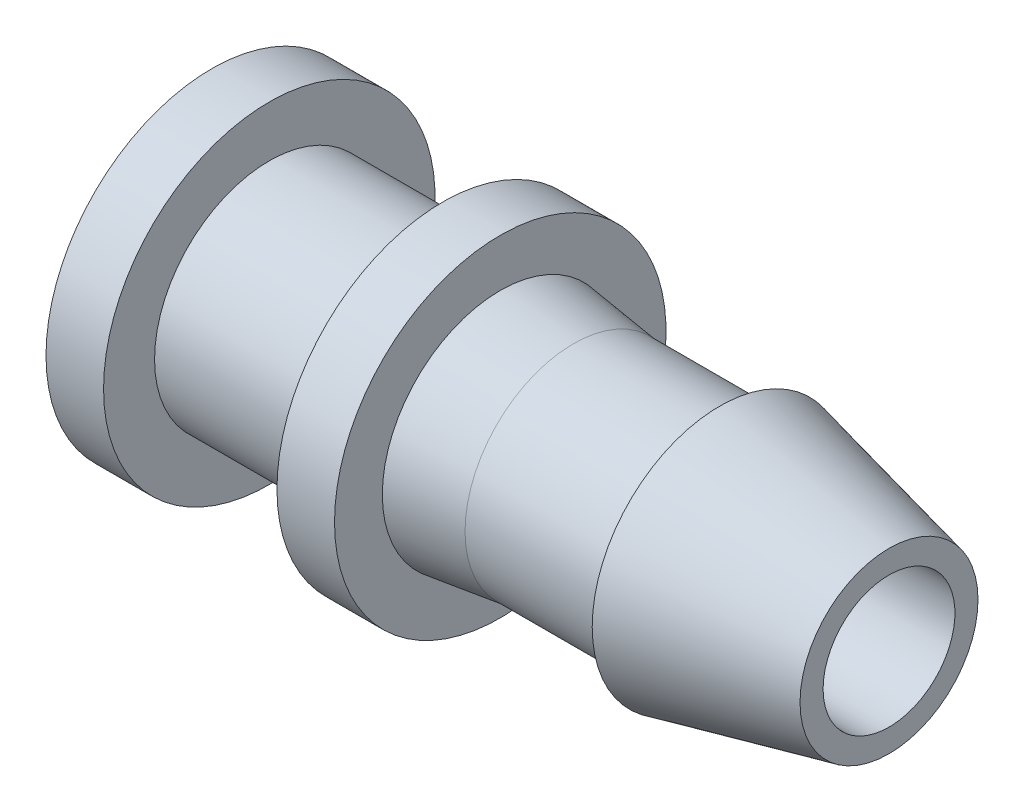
ISO-10303-21;
HEADER;
FILE_DESCRIPTION(('STEP AP214'),'2;1');
FILE_NAME('part.step','',(''),(''),'','','');
FILE_SCHEMA(('AUTOMOTIVE_DESIGN { 1 0 10303 214 1 1 1 1 }'));
ENDSEC;
DATA;
#1=APPLICATION_CONTEXT('core data for automotive mechanical design processes');
#2=APPLICATION_PROTOCOL_DEFINITION('international standard','automotive_design',2000,#1);
#3=PRODUCT_CONTEXT('',#1,'mechanical');
#4=PRODUCT('Part','Part','',(#3));
#5=PRODUCT_RELATED_PRODUCT_CATEGORY('part','',(#4));
#6=PRODUCT_DEFINITION_FORMATION('','',#4);
#7=PRODUCT_DEFINITION_CONTEXT('part definition',#1,'design');
#8=PRODUCT_DEFINITION('design','',#6,#7);
#9=PRODUCT_DEFINITION_SHAPE('','',#8);
#10=(LENGTH_UNIT() NAMED_UNIT(*) SI_UNIT(.MILLI.,.METRE.));
#11=(NAMED_UNIT(*) PLANE_ANGLE_UNIT() SI_UNIT($,.RADIAN.));
#12=(NAMED_UNIT(*) SI_UNIT($,.STERADIAN.) SOLID_ANGLE_UNIT());
#13=UNCERTAINTY_MEASURE_WITH_UNIT(LENGTH_MEASURE(1.E-05),#10,'distance_accuracy_value','');
#14=(GEOMETRIC_REPRESENTATION_CONTEXT(3) GLOBAL_UNCERTAINTY_ASSIGNED_CONTEXT((#13)) GLOBAL_UNIT_ASSIGNED_CONTEXT((#10,
#11,#12)) REPRESENTATION_CONTEXT('',''));
#15=CARTESIAN_POINT('',(0.,0.,0.));
#16=DIRECTION('',(0.,0.,1.));
#17=DIRECTION('',(1.,0.,0.));
#18=AXIS2_PLACEMENT_3D('',#15,#16,#17);
#19=CARTESIAN_POINT('',(0.,0.,0.));
#20=DIRECTION('',(-1.,0.,0.));
#21=DIRECTION('',(0.,0.,1.));
#22=AXIS2_PLACEMENT_3D('',#19,#20,#21);
#23=CYLINDRICAL_SURFACE('',#22,2.3114);
#24=CARTESIAN_POINT('',(18.690463,0.,0.));
#25=DIRECTION('',(-1.,0.,0.));
#26=DIRECTION('',(0.,0.,1.));
#27=AXIS2_PLACEMENT_3D('',#24,#25,#26);
#28=CIRCLE('',#27,2.3114);
#29=CARTESIAN_POINT('',(18.690463,0.,2.3114));
#30=VERTEX_POINT('',#29);
#31=EDGE_CURVE('E76',#30,#30,#28,.T.);
#32=ORIENTED_EDGE('',*,*,#31,.F.);
#33=EDGE_LOOP('',(#32));
#34=FACE_BOUND('',#33,.T.);
#35=CARTESIAN_POINT('',(-3.039872,0.,0.));
#36=DIRECTION('',(-1.,0.,0.));
#37=DIRECTION('',(0.,0.,1.));
#38=AXIS2_PLACEMENT_3D('',#35,#36,#37);
#39=CIRCLE('',#38,2.3114);
#40=CARTESIAN_POINT('',(-3.039872,0.,2.3114));
#41=VERTEX_POINT('',#40);
#42=EDGE_CURVE('E10',#41,#41,#39,.T.);
#43=ORIENTED_EDGE('',*,*,#42,.T.);
#44=EDGE_LOOP('',(#43));
#45=FACE_BOUND('',#44,.T.);
#46=ADVANCED_FACE('F33',(#34,#45),#23,.F.);
#47=CARTESIAN_POINT('',(-3.039872,0.,0.));
#48=DIRECTION('',(-1.,0.,0.));
#49=DIRECTION('',(0.,0.,1.));
#50=AXIS2_PLACEMENT_3D('',#47,#48,#49);
#51=PLANE('',#50);
#52=ORIENTED_EDGE('',*,*,#42,.F.);
#53=EDGE_LOOP('',(#52));
#54=FACE_BOUND('',#53,.T.);
#55=ADVANCED_FACE('F83',(#54),#51,.F.);
#56=CARTESIAN_POINT('',(-5.058537,0.,0.));
#57=DIRECTION('',(1.,0.,0.));
#58=DIRECTION('',(0.,0.,-1.));
#59=AXIS2_PLACEMENT_3D('',#56,#57,#58);
#60=PLANE('',#59);
#61=CARTESIAN_POINT('',(-5.058537,0.,0.));
#62=DIRECTION('',(-1.,0.,0.));
#63=DIRECTION('',(0.,0.,1.));
#64=AXIS2_PLACEMENT_3D('',#61,#62,#63);
#65=CIRCLE('',#64,5.81152);
#66=CARTESIAN_POINT('',(-5.058537,0.,5.81152));
#67=VERTEX_POINT('',#66);
#68=EDGE_CURVE('E39',#67,#67,#65,.T.);
#69=ORIENTED_EDGE('',*,*,#68,.T.);
#70=EDGE_LOOP('',(#69));
#71=FACE_BOUND('',#70,.T.);
#72=ADVANCED_FACE('F87',(#71),#60,.F.);
#73=CARTESIAN_POINT('',(0.,0.,0.));
#74=DIRECTION('',(-1.,0.,0.));
#75=DIRECTION('',(0.,0.,1.));
#76=AXIS2_PLACEMENT_3D('',#73,#74,#75);
#77=CYLINDRICAL_SURFACE('',#76,5.81152);
#78=ORIENTED_EDGE('',*,*,#68,.F.);
#79=EDGE_LOOP('',(#78));
#80=FACE_BOUND('',#79,.T.);
#81=CARTESIAN_POINT('',(-3.039872,0.,0.));
#82=DIRECTION('',(-1.,0.,0.));
#83=DIRECTION('',(0.,0.,1.));
#84=AXIS2_PLACEMENT_3D('',#81,#82,#83);
#85=CIRCLE('',#84,5.81152);
#86=CARTESIAN_POINT('',(-3.039872,0.,5.81152));
#87=VERTEX_POINT('',#86);
#88=EDGE_CURVE('E43',#87,#87,#85,.T.);
#89=ORIENTED_EDGE('',*,*,#88,.T.);
#90=EDGE_LOOP('',(#89));
#91=FACE_BOUND('',#90,.T.);
#92=ADVANCED_FACE('F92',(#80,#91),#77,.T.);
#93=CARTESIAN_POINT('',(-3.039872,5.81152,0.));
#94=DIRECTION('',(-1.,0.,0.));
#95=DIRECTION('',(0.,0.,1.));
#96=AXIS2_PLACEMENT_3D('',#93,#94,#95);
#97=PLANE('',#96);
#98=ORIENTED_EDGE('',*,*,#88,.F.);
#99=EDGE_LOOP('',(#98));
#100=FACE_BOUND('',#99,.T.);
#101=CARTESIAN_POINT('',(-3.039872,0.,0.));
#102=DIRECTION('',(-1.,0.,0.));
#103=DIRECTION('',(0.,0.,1.));
#104=AXIS2_PLACEMENT_3D('',#101,#102,#103);
#105=CIRCLE('',#104,4.02336);
#106=CARTESIAN_POINT('',(-3.039872,0.,4.02336));
#107=VERTEX_POINT('',#106);
#108=EDGE_CURVE('E47',#107,#107,#105,.T.);
#109=ORIENTED_EDGE('',*,*,#108,.T.);
#110=EDGE_LOOP('',(#109));
#111=FACE_BOUND('',#110,.T.);
#112=ADVANCED_FACE('F97',(#100,#111),#97,.F.);
#113=CARTESIAN_POINT('',(0.,0.,0.));
#114=DIRECTION('',(-1.,0.,0.));
#115=DIRECTION('',(0.,0.,1.));
#116=AXIS2_PLACEMENT_3D('',#113,#114,#115);
#117=CYLINDRICAL_SURFACE('',#116,4.02336);
#118=ORIENTED_EDGE('',*,*,#108,.F.);
#119=EDGE_LOOP('',(#118));
#120=FACE_BOUND('',#119,.T.);
#121=CARTESIAN_POINT('',(3.039872,0.,0.));
#122=DIRECTION('',(-1.,0.,0.));
#123=DIRECTION('',(0.,0.,1.));
#124=AXIS2_PLACEMENT_3D('',#121,#122,#123);
#125=CIRCLE('',#124,4.02336);
#126=CARTESIAN_POINT('',(3.039872,0.,4.02336));
#127=VERTEX_POINT('',#126);
#128=EDGE_CURVE('E52',#127,#127,#125,.T.);
#129=ORIENTED_EDGE('',*,*,#128,.T.);
#130=EDGE_LOOP('',(#129));
#131=FACE_BOUND('',#130,.T.);
#132=ADVANCED_FACE('F101',(#120,#131),#117,.T.);
#133=CARTESIAN_POINT('',(3.039872,5.81152,0.));
#134=DIRECTION('',(1.,0.,0.));
#135=DIRECTION('',(0.,0.,-1.));
#136=AXIS2_PLACEMENT_3D('',#133,#134,#135);
#137=PLANE('',#136);
#138=ORIENTED_EDGE('',*,*,#128,.F.);
#139=EDGE_LOOP('',(#138));
#140=FACE_BOUND('',#139,.T.);
#141=CARTESIAN_POINT('',(3.039872,0.,0.));
#142=DIRECTION('',(-1.,0.,0.));
#143=DIRECTION('',(0.,0.,1.));
#144=AXIS2_PLACEMENT_3D('',#141,#142,#143);
#145=CIRCLE('',#144,5.81152);
#146=CARTESIAN_POINT('',(3.039872,0.,5.81152));
#147=VERTEX_POINT('',#146);
#148=EDGE_CURVE('E55',#147,#147,#145,.T.);
#149=ORIENTED_EDGE('',*,*,#148,.T.);
#150=EDGE_LOOP('',(#149));
#151=FACE_BOUND('',#150,.T.);
#152=ADVANCED_FACE('F105',(#140,#151),#137,.F.);
#153=CARTESIAN_POINT('',(0.,0.,0.));
#154=DIRECTION('',(-1.,0.,0.));
#155=DIRECTION('',(0.,0.,1.));
#156=AXIS2_PLACEMENT_3D('',#153,#154,#155);
#157=CYLINDRICAL_SURFACE('',#156,5.81152);
#158=ORIENTED_EDGE('',*,*,#148,.F.);
#159=EDGE_LOOP('',(#158));
#160=FACE_BOUND('',#159,.T.);
#161=CARTESIAN_POINT('',(5.058537,0.,0.));
#162=DIRECTION('',(-1.,0.,0.));
#163=DIRECTION('',(0.,0.,1.));
#164=AXIS2_PLACEMENT_3D('',#161,#162,#163);
#165=CIRCLE('',#164,5.81152);
#166=CARTESIAN_POINT('',(5.058537,0.,5.81152));
#167=VERTEX_POINT('',#166);
#168=EDGE_CURVE('E58',#167,#167,#165,.T.);
#169=ORIENTED_EDGE('',*,*,#168,.T.);
#170=EDGE_LOOP('',(#169));
#171=FACE_BOUND('',#170,.T.);
#172=ADVANCED_FACE('F109',(#160,#171),#157,.T.);
#173=CARTESIAN_POINT('',(5.058537,4.13512,0.));
#174=DIRECTION('',(-1.,0.,0.));
#175=DIRECTION('',(0.,0.,1.));
#176=AXIS2_PLACEMENT_3D('',#173,#174,#175);
#177=PLANE('',#176);
#178=ORIENTED_EDGE('',*,*,#168,.F.);
#179=EDGE_LOOP('',(#178));
#180=FACE_BOUND('',#179,.T.);
#181=CARTESIAN_POINT('',(5.058537,0.,0.));
#182=DIRECTION('',(-1.,0.,0.));
#183=DIRECTION('',(0.,0.,1.));
#184=AXIS2_PLACEMENT_3D('',#181,#182,#183);
#185=CIRCLE('',#184,4.13512);
#186=CARTESIAN_POINT('',(5.058537,0.,4.13512));
#187=VERTEX_POINT('',#186);
#188=EDGE_CURVE('E61',#187,#187,#185,.T.);
#189=ORIENTED_EDGE('',*,*,#188,.T.);
#190=EDGE_LOOP('',(#189));
#191=FACE_BOUND('',#190,.T.);
#192=ADVANCED_FACE('F113',(#180,#191),#177,.F.);
#193=CARTESIAN_POINT('',(7.623429,0.,0.));
#194=DIRECTION('',(-1.,0.,0.));
#195=DIRECTION('',(0.,0.,1.));
#196=AXIS2_PLACEMENT_3D('',#193,#194,#195);
#197=CONICAL_SURFACE('',#196,3.79984,0.129981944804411);
#198=ORIENTED_EDGE('',*,*,#188,.F.);
#199=EDGE_LOOP('',(#198));
#200=FACE_BOUND('',#199,.T.);
#201=CARTESIAN_POINT('',(7.623429,0.,0.));
#202=DIRECTION('',(-1.,0.,0.));
#203=DIRECTION('',(0.,0.,1.));
#204=AXIS2_PLACEMENT_3D('',#201,#202,#203);
#205=CIRCLE('',#204,3.79984);
#206=CARTESIAN_POINT('',(7.623429,0.,3.79984));
#207=VERTEX_POINT('',#206);
#208=EDGE_CURVE('E64',#207,#207,#205,.T.);
#209=ORIENTED_EDGE('',*,*,#208,.T.);
#210=EDGE_LOOP('',(#209));
#211=FACE_BOUND('',#210,.T.);
#212=ADVANCED_FACE('F117',(#200,#211),#197,.T.);
#213=CARTESIAN_POINT('',(0.,0.,0.));
#214=DIRECTION('',(-1.,0.,0.));
#215=DIRECTION('',(0.,0.,1.));
#216=AXIS2_PLACEMENT_3D('',#213,#214,#215);
#217=CYLINDRICAL_SURFACE('',#216,3.79984);
#218=ORIENTED_EDGE('',*,*,#208,.F.);
#219=EDGE_LOOP('',(#218));
#220=FACE_BOUND('',#219,.T.);
#221=CARTESIAN_POINT('',(12.753213,0.,0.));
#222=DIRECTION('',(-1.,0.,0.));
#223=DIRECTION('',(0.,0.,1.));
#224=AXIS2_PLACEMENT_3D('',#221,#222,#223);
#225=CIRCLE('',#224,3.79984);
#226=CARTESIAN_POINT('',(12.753213,0.,3.79984));
#227=VERTEX_POINT('',#226);
#228=EDGE_CURVE('E67',#227,#227,#225,.T.);
#229=ORIENTED_EDGE('',*,*,#228,.T.);
#230=EDGE_LOOP('',(#229));
#231=FACE_BOUND('',#230,.T.);
#232=ADVANCED_FACE('F121',(#220,#231),#217,.T.);
#233=CARTESIAN_POINT('',(12.753213,4.4704,0.));
#234=DIRECTION('',(1.,0.,0.));
#235=DIRECTION('',(0.,0.,-1.));
#236=AXIS2_PLACEMENT_3D('',#233,#234,#235);
#237=PLANE('',#236);
#238=ORIENTED_EDGE('',*,*,#228,.F.);
#239=EDGE_LOOP('',(#238));
#240=FACE_BOUND('',#239,.T.);
#241=CARTESIAN_POINT('',(12.753213,0.,0.));
#242=DIRECTION('',(-1.,0.,0.));
#243=DIRECTION('',(0.,0.,1.));
#244=AXIS2_PLACEMENT_3D('',#241,#242,#243);
#245=CIRCLE('',#244,4.4704);
#246=CARTESIAN_POINT('',(12.753213,0.,4.4704));
#247=VERTEX_POINT('',#246);
#248=EDGE_CURVE('E70',#247,#247,#245,.T.);
#249=ORIENTED_EDGE('',*,*,#248,.T.);
#250=EDGE_LOOP('',(#249));
#251=FACE_BOUND('',#250,.T.);
#252=ADVANCED_FACE('F125',(#240,#251),#237,.F.);
#253=CARTESIAN_POINT('',(18.690463,0.,0.));
#254=DIRECTION('',(-1.,0.,0.));
#255=DIRECTION('',(0.,0.,1.));
#256=AXIS2_PLACEMENT_3D('',#253,#254,#255);
#257=CONICAL_SURFACE('',#256,3.12039,0.223578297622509);
#258=ORIENTED_EDGE('',*,*,#248,.F.);
#259=EDGE_LOOP('',(#258));
#260=FACE_BOUND('',#259,.T.);
#261=CARTESIAN_POINT('',(18.690463,0.,0.));
#262=DIRECTION('',(-1.,0.,0.));
#263=DIRECTION('',(0.,0.,1.));
#264=AXIS2_PLACEMENT_3D('',#261,#262,#263);
#265=CIRCLE('',#264,3.12039);
#266=CARTESIAN_POINT('',(18.690463,0.,3.12039));
#267=VERTEX_POINT('',#266);
#268=EDGE_CURVE('E73',#267,#267,#265,.T.);
#269=ORIENTED_EDGE('',*,*,#268,.T.);
#270=EDGE_LOOP('',(#269));
#271=FACE_BOUND('',#270,.T.);
#272=ADVANCED_FACE('F129',(#260,#271),#257,.T.);
#273=CARTESIAN_POINT('',(18.690463,2.3114,0.));
#274=DIRECTION('',(-1.,0.,0.));
#275=DIRECTION('',(0.,0.,1.));
#276=AXIS2_PLACEMENT_3D('',#273,#274,#275);
#277=PLANE('',#276);
#278=ORIENTED_EDGE('',*,*,#268,.F.);
#279=EDGE_LOOP('',(#278));
#280=FACE_BOUND('',#279,.T.);
#281=ORIENTED_EDGE('',*,*,#31,.T.);
#282=EDGE_LOOP('',(#281));
#283=FACE_BOUND('',#282,.T.);
#284=ADVANCED_FACE('F80',(#280,#283),#277,.F.);
#285=CLOSED_SHELL('',(#46,#55,#72,#92,#112,#132,#152,#172,#192,#212,#232,#252,#272,#284));
#286=MANIFOLD_SOLID_BREP('B2',#285);
#287=ADVANCED_BREP_SHAPE_REPRESENTATION('',(#18,#286),#14);
#288=SHAPE_DEFINITION_REPRESENTATION(#9,#287);
ENDSEC;
END-ISO-10303-21;
